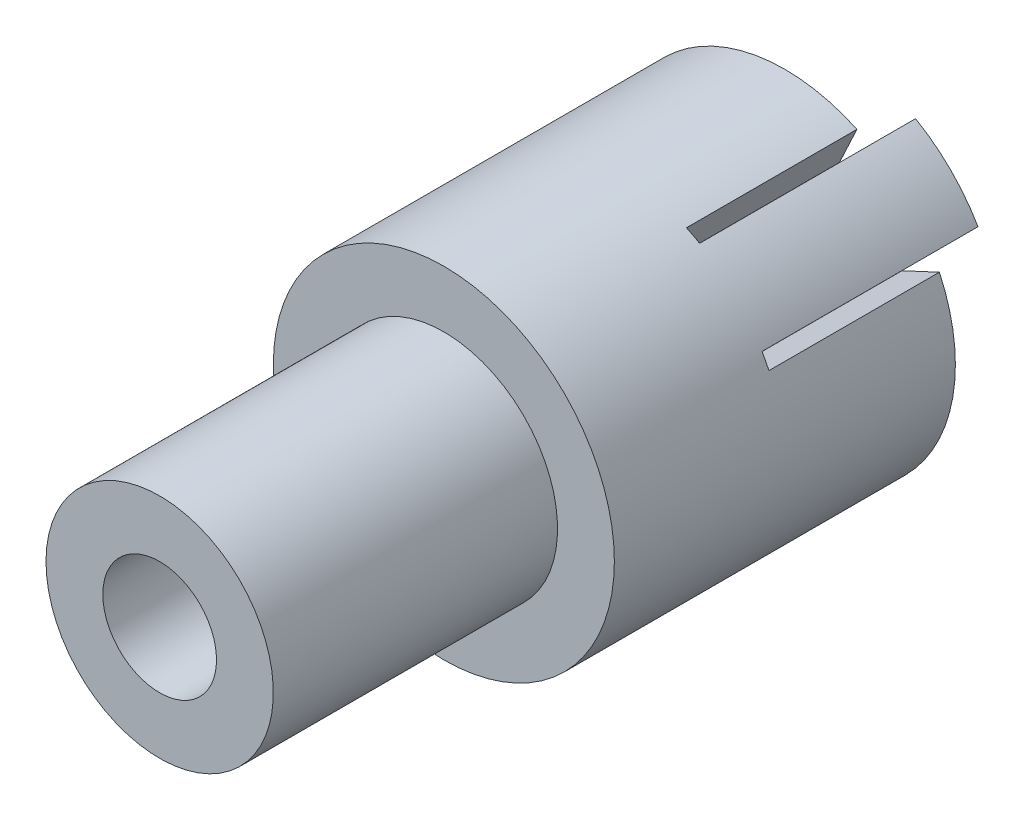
from build123d import *

# Parameters (mm, degrees)
CUT_EXTRUDE1_DEPTH  = 12.446
CUT_EXTRUDE2_DEPTH  = 7.62
BOSS_EXTRUDE1_START = 2.032
BOSS_EXTRUDE1_DEPTH = 2.032


with BuildPart() as part:
    # Sketch2 → Revolve1 (revolve)
    with BuildSketch(Plane(origin=(0, 0, 0), x_dir=(0, 0, -1), z_dir=(1, 0, 0)), mode=Mode.PRIVATE) as revolve1_sk:
        Polygon((-8.279886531, -1.379942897), (-8.279886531, -3.919942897), (4.420113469, -3.919942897), (4.420113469, -6.459942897), (6.960113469, -6.459942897), (6.960113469, -2.716438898), (7.468113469, -2.716438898), (9.452278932, -0.685002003), (11.532113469, -2.716438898), (13.516278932, -0.685002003), (15.596113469, -2.716438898), (17.580278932, -0.685002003), (19.660113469, -2.716438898), (19.660113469, 1.160057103), (6.960113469, 1.160057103), (4.420113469, 1.160057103), (4.420113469, -1.379942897), align=None)
    revolve(revolve1_sk.sketch.rotate(Axis((0, -6.459942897, -23.438338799), (0, 0, 1)), 90), axis=Axis((0, -6.459942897, -23.438338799), (0, 0, 1)))

    # Sketch3 → Cut-Extrude1 (cut)
    with BuildSketch(Plane(origin=(0, 0, -19.660113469), x_dir=(-1, 0, 0), z_dir=(0, 0, -1))):
        with BuildLine():
            Line((0, -2.716438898), (0, -0.684438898))
            ThreePointArc((0, -0.684438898), (-4.083898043, -2.376044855), (-5.775503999, -6.459942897))
            Line((-5.775503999, -6.459942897), (-3.743503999, -6.459942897))
            ThreePointArc((-3.743503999, -6.459942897), (-2.647057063, -3.812885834), (0, -2.716438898))
        make_face()
        with BuildLine():
            Line((0, -10.203446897), (0, -12.235446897))
            ThreePointArc((0, -12.235446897), (4.083898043, -10.54384094), (5.775503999, -6.459942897))
            Line((5.775503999, -6.459942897), (3.743503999, -6.459942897))
            ThreePointArc((3.743503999, -6.459942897), (2.647057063, -9.106999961), (0, -10.203446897))
        make_face()
    extrude(amount=-CUT_EXTRUDE1_DEPTH, mode=Mode.SUBTRACT)

    # Sketch4 → Cut-Extrude2 (cut)
    with BuildSketch(Plane(origin=(0, 0, -19.660113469), x_dir=(-1, 0, 0), z_dir=(0, 0, -1))):
        with BuildLine():
            Line((-2.887752, -1.458209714), (-3.81, 0.13917068))
            ThreePointArc((-3.81, 0.13917068), (-3.518524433, 0.299079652), (-3.220351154, 0.44612244))
            Line((-3.220351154, 0.44612244), (-2.440833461, -1.225558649))
            ThreePointArc((-2.440833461, -1.225558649), (-2.666830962, -1.337008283), (-2.887752, -1.458209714))
        make_face()
        with BuildLine():
            Line((-5.234384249, -4.019109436), (-6.906065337, -3.239591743))
            ThreePointArc((-6.906065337, -3.239591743), (-6.759022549, -2.941418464), (-6.599113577, -2.649942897))
            Line((-6.599113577, -2.649942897), (-5.001733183, -3.572190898))
            ThreePointArc((-5.001733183, -3.572190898), (-5.122934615, -3.793111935), (-5.234384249, -4.019109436))
        make_face()
    extrude(amount=-CUT_EXTRUDE2_DEPTH, mode=Mode.SUBTRACT)

    # Sketch7 → Boss-Extrude1 (add)
    with BuildSketch(Plane(origin=(0, 0, -19.660113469), x_dir=(-1, 0, 0), z_dir=(0, 0, -1)).offset(BOSS_EXTRUDE1_START)):
        with BuildLine():
            Line((-5.001733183, -3.572190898), (-6.599113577, -2.649942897))
            ThreePointArc((-6.599113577, -2.649942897), (-5.388153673, -1.071789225), (-3.81, 0.13917068))
            Line((-3.81, 0.13917068), (-2.887752, -1.458209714))
            ThreePointArc((-2.887752, -1.458209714), (-4.083898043, -2.376044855), (-5.001733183, -3.572190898))
        make_face()
    extrude(amount=-BOSS_EXTRUDE1_DEPTH)

    # Sketch8 → Cut-Revolve2 (revolve, cut)
    with BuildSketch(Plane(origin=(2.797237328, -4.844957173, 0), x_dir=(0.8660254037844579, 0.49999999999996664, 0), z_dir=(0.49999999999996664, -0.8660254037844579, 0))):
        Polygon((3.053532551, -21.692113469), (2.545532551, -20.598576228), (2.545532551, -21.692113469), align=None)
    revolve(axis=Axis((-0.057587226, -6.493190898, -21.692113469), (0, 0, 1)), mode=Mode.SUBTRACT)


solid = part.part
